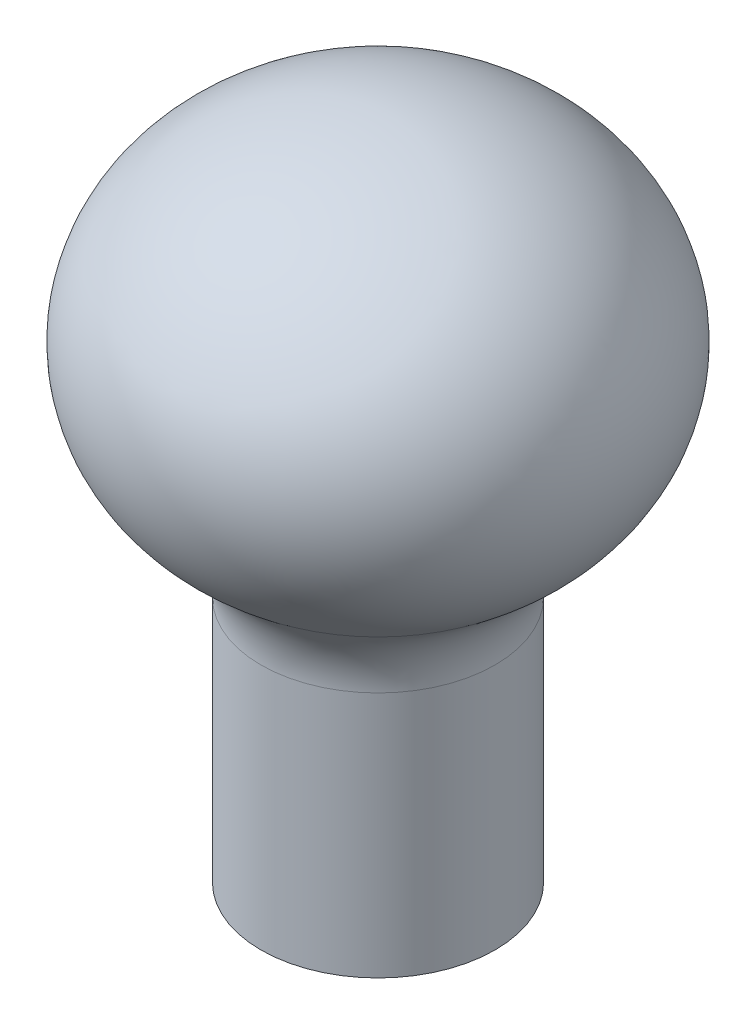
ISO-10303-21;
HEADER;
FILE_DESCRIPTION(('STEP AP214'),'2;1');
FILE_NAME('part.step','',(''),(''),'','','');
FILE_SCHEMA(('AUTOMOTIVE_DESIGN { 1 0 10303 214 1 1 1 1 }'));
ENDSEC;
DATA;
#1=APPLICATION_CONTEXT('core data for automotive mechanical design processes');
#2=APPLICATION_PROTOCOL_DEFINITION('international standard','automotive_design',2000,#1);
#3=PRODUCT_CONTEXT('',#1,'mechanical');
#4=PRODUCT('Part','Part','',(#3));
#5=PRODUCT_RELATED_PRODUCT_CATEGORY('part','',(#4));
#6=PRODUCT_DEFINITION_FORMATION('','',#4);
#7=PRODUCT_DEFINITION_CONTEXT('part definition',#1,'design');
#8=PRODUCT_DEFINITION('design','',#6,#7);
#9=PRODUCT_DEFINITION_SHAPE('','',#8);
#10=(LENGTH_UNIT() NAMED_UNIT(*) SI_UNIT(.MILLI.,.METRE.));
#11=(NAMED_UNIT(*) PLANE_ANGLE_UNIT() SI_UNIT($,.RADIAN.));
#12=(NAMED_UNIT(*) SI_UNIT($,.STERADIAN.) SOLID_ANGLE_UNIT());
#13=UNCERTAINTY_MEASURE_WITH_UNIT(LENGTH_MEASURE(1.E-05),#10,'distance_accuracy_value','');
#14=(GEOMETRIC_REPRESENTATION_CONTEXT(3) GLOBAL_UNCERTAINTY_ASSIGNED_CONTEXT((#13)) GLOBAL_UNIT_ASSIGNED_CONTEXT((#10,
#11,#12)) REPRESENTATION_CONTEXT('',''));
#15=CARTESIAN_POINT('',(0.,0.,0.));
#16=DIRECTION('',(0.,0.,1.));
#17=DIRECTION('',(1.,0.,0.));
#18=AXIS2_PLACEMENT_3D('',#15,#16,#17);
#19=CARTESIAN_POINT('',(0.,0.,0.));
#20=DIRECTION('',(0.,-1.,0.));
#21=DIRECTION('',(0.,0.,-1.));
#22=AXIS2_PLACEMENT_3D('',#19,#20,#21);
#23=PLANE('',#22);
#24=CARTESIAN_POINT('',(0.,0.,0.));
#25=DIRECTION('',(0.,-1.,0.));
#26=DIRECTION('',(0.,0.,-1.));
#27=AXIS2_PLACEMENT_3D('',#24,#25,#26);
#28=CIRCLE('',#27,7.5);
#29=CARTESIAN_POINT('',(0.,0.,-7.5));
#30=VERTEX_POINT('',#29);
#31=EDGE_CURVE('E63',#30,#30,#28,.T.);
#32=ORIENTED_EDGE('',*,*,#31,.T.);
#33=EDGE_LOOP('',(#32));
#34=FACE_BOUND('',#33,.T.);
#35=ADVANCED_FACE('F34',(#34),#23,.T.);
#36=CARTESIAN_POINT('',(0.,0.,0.));
#37=DIRECTION('',(0.,-1.,0.));
#38=DIRECTION('',(0.,0.,-1.));
#39=AXIS2_PLACEMENT_3D('',#36,#37,#38);
#40=CYLINDRICAL_SURFACE('',#39,7.5);
#41=CARTESIAN_POINT('',(0.,15.8088278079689,0.));
#42=DIRECTION('',(0.,-1.,0.));
#43=DIRECTION('',(0.,0.,-1.));
#44=AXIS2_PLACEMENT_3D('',#41,#42,#43);
#45=CIRCLE('',#44,7.5);
#46=CARTESIAN_POINT('',(0.,15.8088278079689,-7.5));
#47=VERTEX_POINT('',#46);
#48=EDGE_CURVE('E41',#47,#47,#45,.T.);
#49=ORIENTED_EDGE('',*,*,#48,.T.);
#50=EDGE_LOOP('',(#49));
#51=FACE_BOUND('',#50,.T.);
#52=ORIENTED_EDGE('',*,*,#31,.F.);
#53=EDGE_LOOP('',(#52));
#54=FACE_BOUND('',#53,.T.);
#55=ADVANCED_FACE('F46',(#51,#54),#40,.T.);
#56=CARTESIAN_POINT('',(0.,30.,0.));
#57=DIRECTION('',(0.,0.,1.));
#58=DIRECTION('',(-1.,0.,0.));
#59=AXIS2_PLACEMENT_3D('',#56,#57,#58);
#60=ELLIPSE('',#59,15.,12.5);
#61=TRIMMED_CURVE('',#60,(PARAMETER_VALUE(1.5707963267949)),(PARAMETER_VALUE(4.71238898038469)),
.T.,.PARAMETER.);
#62=CARTESIAN_POINT('',(0.,0.,0.));
#63=DIRECTION('',(0.,-1.,0.));
#64=AXIS1_PLACEMENT('',#62,#63);
#65=SURFACE_OF_REVOLUTION('',#61,#64);
#66=CARTESIAN_POINT('',(0.,20.6381382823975,0.));
#67=DIRECTION('',(0.,-1.,0.));
#68=DIRECTION('',(0.,0.,-1.));
#69=AXIS2_PLACEMENT_3D('',#66,#67,#68);
#70=CIRCLE('',#69,9.93941573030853);
#71=CARTESIAN_POINT('',(0.,20.6381382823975,-9.93941573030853));
#72=VERTEX_POINT('',#71);
#73=EDGE_CURVE('E11',#72,#72,#70,.F.);
#74=ORIENTED_EDGE('',*,*,#73,.T.);
#75=EDGE_LOOP('',(#74));
#76=FACE_BOUND('',#75,.T.);
#77=CARTESIAN_POINT('',(-1.58200975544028E-13,42.5,0.));
#78=VERTEX_POINT('',#77);
#79=VERTEX_LOOP('',#78);
#80=FACE_BOUND('',#79,.T.);
#81=ADVANCED_FACE('F44',(#76,#80),#65,.F.);
#82=CARTESIAN_POINT('',(0.,15.8088278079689,0.));
#83=DIRECTION('',(0.,-1.,0.));
#84=DIRECTION('',(0.,0.,-1.));
#85=AXIS2_PLACEMENT_3D('',#82,#83,#84);
#86=TOROIDAL_SURFACE('',#85,13.5,6.);
#87=ORIENTED_EDGE('',*,*,#73,.F.);
#88=EDGE_LOOP('',(#87));
#89=FACE_BOUND('',#88,.T.);
#90=ORIENTED_EDGE('',*,*,#48,.F.);
#91=EDGE_LOOP('',(#90));
#92=FACE_BOUND('',#91,.T.);
#93=ADVANCED_FACE('F36',(#89,#92),#86,.F.);
#94=CLOSED_SHELL('',(#35,#55,#81,#93));
#95=MANIFOLD_SOLID_BREP('B2',#94);
#96=ADVANCED_BREP_SHAPE_REPRESENTATION('',(#18,#95),#14);
#97=SHAPE_DEFINITION_REPRESENTATION(#9,#96);
ENDSEC;
END-ISO-10303-21;
